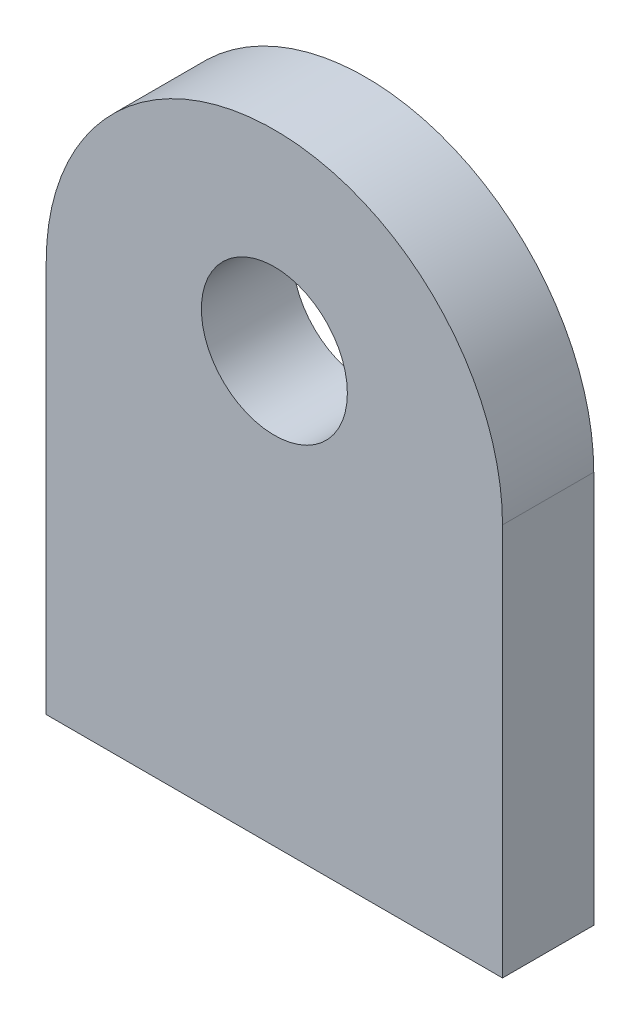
from build123d import *

# Parameters (mm, degrees)
BOSS_EXTRU_1_DEPTH      = 5
ESQUISSE4_R             = 4
ENL_V_MAT_EXTRU_1_DEPTH = 37.568429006


with BuildPart() as part:
    # Esquisse1 → Boss.-Extru.1 (new body)
    with BuildSketch(Plane.XY):
        with BuildLine():
            Line((-12.5, 0), (12.5, 0))
            Line((12.5, 0), (12.5, 21.5))
            ThreePointArc((12.5, 21.5), (0, 34), (-12.5, 21.5))
            Line((-12.5, 21.5), (-12.5, 0))
        make_face()
    extrude(amount=BOSS_EXTRU_1_DEPTH)

    # Esquisse4 → Enl_v. mat.-Extru.1 (cut, through all)
    with BuildSketch(Plane.XY.offset(5)):
        with Locations((0, 23.5)):
            Circle(ESQUISSE4_R)
    extrude(amount=-ENL_V_MAT_EXTRU_1_DEPTH, mode=Mode.SUBTRACT)


solid = part.part
